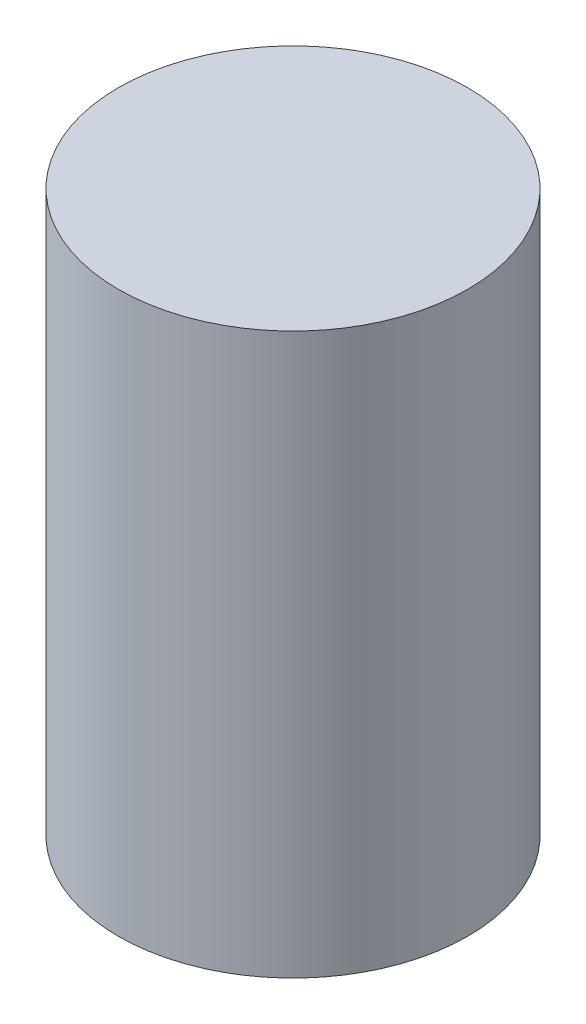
from build123d import *

# Parameters (mm, degrees)
SKETCH1_R      = 1.5875
EXTRUDE1_DEPTH = 2.54635


with BuildPart() as part:
    # Sketch1 → Extrude1 (new, symmetric)
    with BuildSketch(Plane(origin=(0, 0, 0), x_dir=(1, 0, 0), z_dir=(0, 1, 0))):
        with Locations(Location((0, 0, 0), (0, 0, 270))):
            Circle(SKETCH1_R)
    extrude(amount=EXTRUDE1_DEPTH, both=True)


solid = part.part
